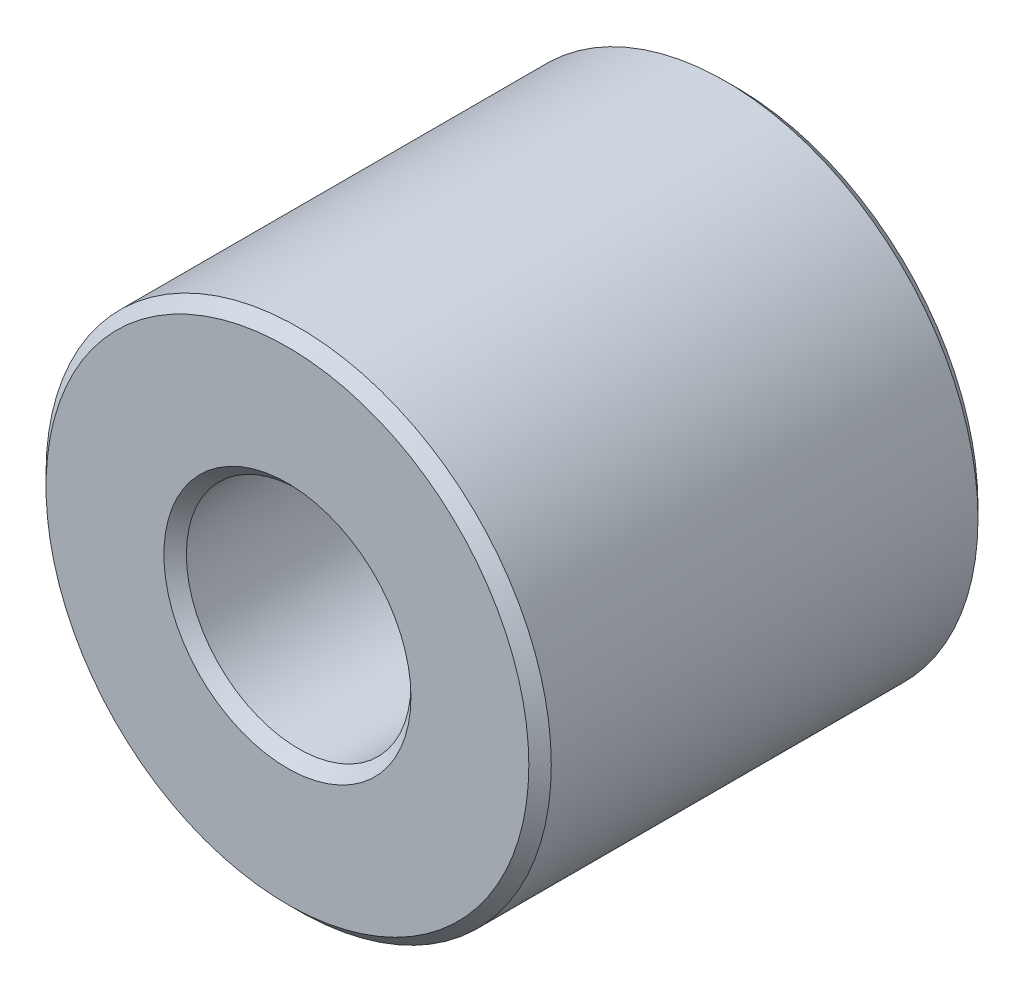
ISO-10303-21;
HEADER;
FILE_DESCRIPTION(('STEP AP214'),'2;1');
FILE_NAME('part.step','',(''),(''),'','','');
FILE_SCHEMA(('AUTOMOTIVE_DESIGN { 1 0 10303 214 1 1 1 1 }'));
ENDSEC;
DATA;
#1=APPLICATION_CONTEXT('core data for automotive mechanical design processes');
#2=APPLICATION_PROTOCOL_DEFINITION('international standard','automotive_design',2000,#1);
#3=PRODUCT_CONTEXT('',#1,'mechanical');
#4=PRODUCT('Part','Part','',(#3));
#5=PRODUCT_RELATED_PRODUCT_CATEGORY('part','',(#4));
#6=PRODUCT_DEFINITION_FORMATION('','',#4);
#7=PRODUCT_DEFINITION_CONTEXT('part definition',#1,'design');
#8=PRODUCT_DEFINITION('design','',#6,#7);
#9=PRODUCT_DEFINITION_SHAPE('','',#8);
#10=(LENGTH_UNIT() NAMED_UNIT(*) SI_UNIT(.MILLI.,.METRE.));
#11=(NAMED_UNIT(*) PLANE_ANGLE_UNIT() SI_UNIT($,.RADIAN.));
#12=(NAMED_UNIT(*) SI_UNIT($,.STERADIAN.) SOLID_ANGLE_UNIT());
#13=UNCERTAINTY_MEASURE_WITH_UNIT(LENGTH_MEASURE(1.E-05),#10,'distance_accuracy_value','');
#14=(GEOMETRIC_REPRESENTATION_CONTEXT(3) GLOBAL_UNCERTAINTY_ASSIGNED_CONTEXT((#13)) GLOBAL_UNIT_ASSIGNED_CONTEXT((#10,
#11,#12)) REPRESENTATION_CONTEXT('',''));
#15=CARTESIAN_POINT('',(0.,0.,0.));
#16=DIRECTION('',(0.,0.,1.));
#17=DIRECTION('',(1.,0.,0.));
#18=AXIS2_PLACEMENT_3D('',#15,#16,#17);
#19=CARTESIAN_POINT('',(0.,0.,8.));
#20=DIRECTION('',(0.,0.,1.));
#21=DIRECTION('',(1.,0.,0.));
#22=AXIS2_PLACEMENT_3D('',#19,#20,#21);
#23=PLANE('',#22);
#24=CARTESIAN_POINT('',(0.,0.,8.));
#25=DIRECTION('',(0.,0.,1.));
#26=DIRECTION('',(1.,0.,0.));
#27=AXIS2_PLACEMENT_3D('',#24,#25,#26);
#28=CIRCLE('',#27,4.39999999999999);
#29=CARTESIAN_POINT('',(4.39999999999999,0.,8.));
#30=VERTEX_POINT('',#29);
#31=EDGE_CURVE('E10',#30,#30,#28,.F.);
#32=ORIENTED_EDGE('',*,*,#31,.T.);
#33=EDGE_LOOP('',(#32));
#34=FACE_BOUND('',#33,.T.);
#35=CARTESIAN_POINT('',(0.,0.,8.));
#36=DIRECTION('',(0.,0.,1.));
#37=DIRECTION('',(1.,0.,0.));
#38=AXIS2_PLACEMENT_3D('',#35,#36,#37);
#39=CIRCLE('',#38,8.6);
#40=CARTESIAN_POINT('',(8.6,0.,8.));
#41=VERTEX_POINT('',#40);
#42=EDGE_CURVE('E45',#41,#41,#39,.T.);
#43=ORIENTED_EDGE('',*,*,#42,.T.);
#44=EDGE_LOOP('',(#43));
#45=FACE_BOUND('',#44,.T.);
#46=ADVANCED_FACE('F37',(#34,#45),#23,.T.);
#47=CARTESIAN_POINT('',(0.,0.,-8.));
#48=DIRECTION('',(0.,0.,1.));
#49=DIRECTION('',(1.,0.,0.));
#50=AXIS2_PLACEMENT_3D('',#47,#48,#49);
#51=PLANE('',#50);
#52=CARTESIAN_POINT('',(0.,0.,-8.));
#53=DIRECTION('',(0.,0.,1.));
#54=DIRECTION('',(1.,0.,0.));
#55=AXIS2_PLACEMENT_3D('',#52,#53,#54);
#56=CIRCLE('',#55,4.39999999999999);
#57=CARTESIAN_POINT('',(4.39999999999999,0.,-8.));
#58=VERTEX_POINT('',#57);
#59=EDGE_CURVE('E70',#58,#58,#56,.T.);
#60=ORIENTED_EDGE('',*,*,#59,.T.);
#61=EDGE_LOOP('',(#60));
#62=FACE_BOUND('',#61,.T.);
#63=CARTESIAN_POINT('',(0.,0.,-8.));
#64=DIRECTION('',(0.,0.,1.));
#65=DIRECTION('',(1.,0.,0.));
#66=AXIS2_PLACEMENT_3D('',#63,#64,#65);
#67=CIRCLE('',#66,8.6);
#68=CARTESIAN_POINT('',(8.6,0.,-8.));
#69=VERTEX_POINT('',#68);
#70=EDGE_CURVE('E74',#69,#69,#67,.F.);
#71=ORIENTED_EDGE('',*,*,#70,.T.);
#72=EDGE_LOOP('',(#71));
#73=FACE_BOUND('',#72,.T.);
#74=ADVANCED_FACE('F78',(#62,#73),#51,.F.);
#75=CARTESIAN_POINT('',(0.,0.,8.));
#76=DIRECTION('',(0.,0.,-1.));
#77=DIRECTION('',(-1.,0.,0.));
#78=AXIS2_PLACEMENT_3D('',#75,#76,#77);
#79=CYLINDRICAL_SURFACE('',#78,9.);
#80=CARTESIAN_POINT('',(0.,0.,-7.6));
#81=DIRECTION('',(0.,0.,1.));
#82=DIRECTION('',(1.,0.,0.));
#83=AXIS2_PLACEMENT_3D('',#80,#81,#82);
#84=CIRCLE('',#83,9.);
#85=CARTESIAN_POINT('',(9.,0.,-7.6));
#86=VERTEX_POINT('',#85);
#87=EDGE_CURVE('E51',#86,#86,#84,.T.);
#88=ORIENTED_EDGE('',*,*,#87,.T.);
#89=EDGE_LOOP('',(#88));
#90=FACE_BOUND('',#89,.T.);
#91=CARTESIAN_POINT('',(0.,0.,7.6));
#92=DIRECTION('',(0.,0.,1.));
#93=DIRECTION('',(1.,0.,0.));
#94=AXIS2_PLACEMENT_3D('',#91,#92,#93);
#95=CIRCLE('',#94,9.);
#96=CARTESIAN_POINT('',(9.,0.,7.6));
#97=VERTEX_POINT('',#96);
#98=EDGE_CURVE('E56',#97,#97,#95,.F.);
#99=ORIENTED_EDGE('',*,*,#98,.T.);
#100=EDGE_LOOP('',(#99));
#101=FACE_BOUND('',#100,.T.);
#102=ADVANCED_FACE('F88',(#90,#101),#79,.T.);
#103=CARTESIAN_POINT('',(0.,0.,8.));
#104=DIRECTION('',(0.,0.,-1.));
#105=DIRECTION('',(-1.,0.,0.));
#106=AXIS2_PLACEMENT_3D('',#103,#104,#105);
#107=CYLINDRICAL_SURFACE('',#106,4.);
#108=CARTESIAN_POINT('',(0.,0.,-7.6));
#109=DIRECTION('',(0.,0.,1.));
#110=DIRECTION('',(1.,0.,0.));
#111=AXIS2_PLACEMENT_3D('',#108,#109,#110);
#112=CIRCLE('',#111,4.);
#113=CARTESIAN_POINT('',(4.,0.,-7.6));
#114=VERTEX_POINT('',#113);
#115=EDGE_CURVE('E62',#114,#114,#112,.F.);
#116=ORIENTED_EDGE('',*,*,#115,.T.);
#117=EDGE_LOOP('',(#116));
#118=FACE_BOUND('',#117,.T.);
#119=CARTESIAN_POINT('',(0.,0.,7.60000000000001));
#120=DIRECTION('',(0.,0.,1.));
#121=DIRECTION('',(1.,0.,0.));
#122=AXIS2_PLACEMENT_3D('',#119,#120,#121);
#123=CIRCLE('',#122,4.);
#124=CARTESIAN_POINT('',(4.,0.,7.60000000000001));
#125=VERTEX_POINT('',#124);
#126=EDGE_CURVE('E66',#125,#125,#123,.T.);
#127=ORIENTED_EDGE('',*,*,#126,.T.);
#128=EDGE_LOOP('',(#127));
#129=FACE_BOUND('',#128,.T.);
#130=ADVANCED_FACE('F91',(#118,#129),#107,.F.);
#131=CARTESIAN_POINT('',(0.,0.,-8.));
#132=DIRECTION('',(0.,0.,-1.));
#133=DIRECTION('',(-1.,0.,0.));
#134=AXIS2_PLACEMENT_3D('',#131,#132,#133);
#135=CONICAL_SURFACE('',#134,4.39999999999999,0.785398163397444);
#136=ORIENTED_EDGE('',*,*,#115,.F.);
#137=EDGE_LOOP('',(#136));
#138=FACE_BOUND('',#137,.T.);
#139=ORIENTED_EDGE('',*,*,#59,.F.);
#140=EDGE_LOOP('',(#139));
#141=FACE_BOUND('',#140,.T.);
#142=ADVANCED_FACE('F84',(#138,#141),#135,.F.);
#143=CARTESIAN_POINT('',(0.,0.,-7.6));
#144=DIRECTION('',(0.,0.,1.));
#145=DIRECTION('',(1.,0.,0.));
#146=AXIS2_PLACEMENT_3D('',#143,#144,#145);
#147=CONICAL_SURFACE('',#146,9.,0.785398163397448);
#148=ORIENTED_EDGE('',*,*,#70,.F.);
#149=EDGE_LOOP('',(#148));
#150=FACE_BOUND('',#149,.T.);
#151=ORIENTED_EDGE('',*,*,#87,.F.);
#152=EDGE_LOOP('',(#151));
#153=FACE_BOUND('',#152,.T.);
#154=ADVANCED_FACE('F80',(#150,#153),#147,.T.);
#155=CARTESIAN_POINT('',(0.,0.,7.60000000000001));
#156=DIRECTION('',(0.,0.,1.));
#157=DIRECTION('',(1.,0.,0.));
#158=AXIS2_PLACEMENT_3D('',#155,#156,#157);
#159=CONICAL_SURFACE('',#158,4.,0.785398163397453);
#160=ORIENTED_EDGE('',*,*,#31,.F.);
#161=EDGE_LOOP('',(#160));
#162=FACE_BOUND('',#161,.T.);
#163=ORIENTED_EDGE('',*,*,#126,.F.);
#164=EDGE_LOOP('',(#163));
#165=FACE_BOUND('',#164,.T.);
#166=ADVANCED_FACE('F83',(#162,#165),#159,.F.);
#167=CARTESIAN_POINT('',(0.,0.,8.));
#168=DIRECTION('',(0.,0.,-1.));
#169=DIRECTION('',(-1.,0.,0.));
#170=AXIS2_PLACEMENT_3D('',#167,#168,#169);
#171=CONICAL_SURFACE('',#170,8.6,0.785398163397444);
#172=ORIENTED_EDGE('',*,*,#98,.F.);
#173=EDGE_LOOP('',(#172));
#174=FACE_BOUND('',#173,.T.);
#175=ORIENTED_EDGE('',*,*,#42,.F.);
#176=EDGE_LOOP('',(#175));
#177=FACE_BOUND('',#176,.T.);
#178=ADVANCED_FACE('F39',(#174,#177),#171,.T.);
#179=CLOSED_SHELL('',(#46,#74,#102,#130,#142,#154,#166,#178));
#180=MANIFOLD_SOLID_BREP('B2',#179);
#181=ADVANCED_BREP_SHAPE_REPRESENTATION('',(#18,#180),#14);
#182=SHAPE_DEFINITION_REPRESENTATION(#9,#181);
ENDSEC;
END-ISO-10303-21;
